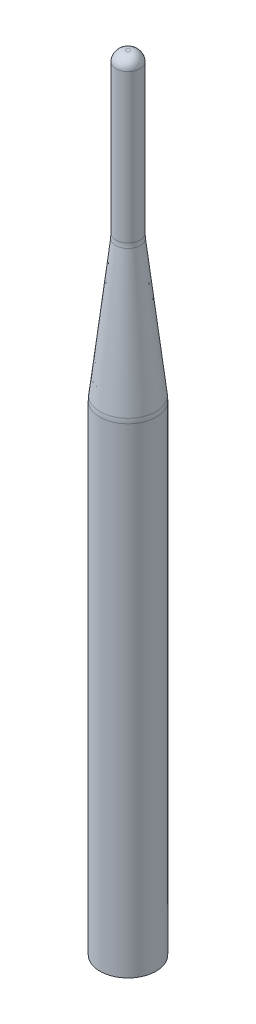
ISO-10303-21;
HEADER;
FILE_DESCRIPTION(('STEP AP214'),'2;1');
FILE_NAME('part.step','',(''),(''),'','','');
FILE_SCHEMA(('AUTOMOTIVE_DESIGN { 1 0 10303 214 1 1 1 1 }'));
ENDSEC;
DATA;
#1=APPLICATION_CONTEXT('core data for automotive mechanical design processes');
#2=APPLICATION_PROTOCOL_DEFINITION('international standard','automotive_design',2000,#1);
#3=PRODUCT_CONTEXT('',#1,'mechanical');
#4=PRODUCT('Part','Part','',(#3));
#5=PRODUCT_RELATED_PRODUCT_CATEGORY('part','',(#4));
#6=PRODUCT_DEFINITION_FORMATION('','',#4);
#7=PRODUCT_DEFINITION_CONTEXT('part definition',#1,'design');
#8=PRODUCT_DEFINITION('design','',#6,#7);
#9=PRODUCT_DEFINITION_SHAPE('','',#8);
#10=(LENGTH_UNIT() NAMED_UNIT(*) SI_UNIT(.MILLI.,.METRE.));
#11=(NAMED_UNIT(*) PLANE_ANGLE_UNIT() SI_UNIT($,.RADIAN.));
#12=(NAMED_UNIT(*) SI_UNIT($,.STERADIAN.) SOLID_ANGLE_UNIT());
#13=UNCERTAINTY_MEASURE_WITH_UNIT(LENGTH_MEASURE(1.E-05),#10,'distance_accuracy_value','');
#14=(GEOMETRIC_REPRESENTATION_CONTEXT(3) GLOBAL_UNCERTAINTY_ASSIGNED_CONTEXT((#13)) GLOBAL_UNIT_ASSIGNED_CONTEXT((#10,
#11,#12)) REPRESENTATION_CONTEXT('',''));
#15=CARTESIAN_POINT('',(0.,0.,0.));
#16=DIRECTION('',(0.,0.,1.));
#17=DIRECTION('',(1.,0.,0.));
#18=AXIS2_PLACEMENT_3D('',#15,#16,#17);
#19=CARTESIAN_POINT('',(0.,0.,0.));
#20=DIRECTION('',(0.,-1.,0.));
#21=DIRECTION('',(0.,0.,-1.));
#22=AXIS2_PLACEMENT_3D('',#19,#20,#21);
#23=PLANE('',#22);
#24=CARTESIAN_POINT('',(0.,0.,0.));
#25=DIRECTION('',(0.,-1.,0.));
#26=DIRECTION('',(0.,0.,-1.));
#27=AXIS2_PLACEMENT_3D('',#24,#25,#26);
#28=CIRCLE('',#27,7.);
#29=CARTESIAN_POINT('',(0.,0.,-7.));
#30=VERTEX_POINT('',#29);
#31=EDGE_CURVE('E10',#30,#30,#28,.T.);
#32=ORIENTED_EDGE('',*,*,#31,.T.);
#33=EDGE_LOOP('',(#32));
#34=FACE_BOUND('',#33,.T.);
#35=ADVANCED_FACE('F31',(#34),#23,.T.);
#36=CARTESIAN_POINT('',(0.,0.,0.));
#37=DIRECTION('',(0.,-1.,0.));
#38=DIRECTION('',(0.,0.,-1.));
#39=AXIS2_PLACEMENT_3D('',#36,#37,#38);
#40=CYLINDRICAL_SURFACE('',#39,7.);
#41=CARTESIAN_POINT('',(0.,119.430425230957,0.));
#42=DIRECTION('',(0.,-1.,0.));
#43=DIRECTION('',(0.,0.,-1.));
#44=AXIS2_PLACEMENT_3D('',#41,#42,#43);
#45=CIRCLE('',#44,7.);
#46=CARTESIAN_POINT('',(0.,119.430425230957,-7.));
#47=VERTEX_POINT('',#46);
#48=EDGE_CURVE('E37',#47,#47,#45,.T.);
#49=ORIENTED_EDGE('',*,*,#48,.T.);
#50=EDGE_LOOP('',(#49));
#51=FACE_BOUND('',#50,.T.);
#52=ORIENTED_EDGE('',*,*,#31,.F.);
#53=EDGE_LOOP('',(#52));
#54=FACE_BOUND('',#53,.T.);
#55=ADVANCED_FACE('F72',(#51,#54),#40,.T.);
#56=CARTESIAN_POINT('',(0.,119.430425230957,0.));
#57=DIRECTION('',(0.,-1.,0.));
#58=DIRECTION('',(0.,0.,-1.));
#59=AXIS2_PLACEMENT_3D('',#56,#57,#58);
#60=DEGENERATE_TOROIDAL_SURFACE('',#59,3.,10.,.F.);
#61=CARTESIAN_POINT('',(0.,120.565891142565,0.));
#62=DIRECTION('',(0.,-1.,0.));
#63=DIRECTION('',(0.,0.,-1.));
#64=AXIS2_PLACEMENT_3D('',#61,#62,#63);
#65=CIRCLE('',#64,6.93532672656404);
#66=CARTESIAN_POINT('',(0.,120.565891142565,-6.93532672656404));
#67=VERTEX_POINT('',#66);
#68=EDGE_CURVE('E41',#67,#67,#65,.T.);
#69=ORIENTED_EDGE('',*,*,#68,.T.);
#70=EDGE_LOOP('',(#69));
#71=FACE_BOUND('',#70,.T.);
#72=ORIENTED_EDGE('',*,*,#48,.F.);
#73=EDGE_LOOP('',(#72));
#74=FACE_BOUND('',#73,.T.);
#75=ADVANCED_FACE('F76',(#71,#74),#60,.F.);
#76=CARTESIAN_POINT('',(0.,120.565891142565,0.));
#77=DIRECTION('',(0.,-1.,0.));
#78=DIRECTION('',(0.,0.,-1.));
#79=AXIS2_PLACEMENT_3D('',#76,#77,#78);
#80=CONICAL_SURFACE('',#79,6.93532672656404,0.113792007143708);
#81=CARTESIAN_POINT('',(0.,154.434108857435,0.));
#82=DIRECTION('',(0.,-1.,0.));
#83=DIRECTION('',(0.,0.,-1.));
#84=AXIS2_PLACEMENT_3D('',#81,#82,#83);
#85=CIRCLE('',#84,3.06467327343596);
#86=CARTESIAN_POINT('',(0.,154.434108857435,-3.06467327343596));
#87=VERTEX_POINT('',#86);
#88=EDGE_CURVE('E45',#87,#87,#85,.T.);
#89=ORIENTED_EDGE('',*,*,#88,.T.);
#90=EDGE_LOOP('',(#89));
#91=FACE_BOUND('',#90,.T.);
#92=ORIENTED_EDGE('',*,*,#68,.F.);
#93=EDGE_LOOP('',(#92));
#94=FACE_BOUND('',#93,.T.);
#95=ADVANCED_FACE('F80',(#91,#94),#80,.T.);
#96=CARTESIAN_POINT('',(0.,155.569574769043,0.));
#97=DIRECTION('',(0.,-1.,0.));
#98=DIRECTION('',(0.,0.,-1.));
#99=AXIS2_PLACEMENT_3D('',#96,#97,#98);
#100=TOROIDAL_SURFACE('',#99,13.,10.);
#101=CARTESIAN_POINT('',(0.,155.569574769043,0.));
#102=DIRECTION('',(0.,-1.,0.));
#103=DIRECTION('',(0.,0.,-1.));
#104=AXIS2_PLACEMENT_3D('',#101,#102,#103);
#105=CIRCLE('',#104,3.00000000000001);
#106=CARTESIAN_POINT('',(0.,155.569574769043,-3.00000000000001));
#107=VERTEX_POINT('',#106);
#108=EDGE_CURVE('E50',#107,#107,#105,.T.);
#109=ORIENTED_EDGE('',*,*,#108,.T.);
#110=EDGE_LOOP('',(#109));
#111=FACE_BOUND('',#110,.T.);
#112=ORIENTED_EDGE('',*,*,#88,.F.);
#113=EDGE_LOOP('',(#112));
#114=FACE_BOUND('',#113,.T.);
#115=ADVANCED_FACE('F87',(#111,#114),#100,.F.);
#116=CARTESIAN_POINT('',(0.,0.,0.));
#117=DIRECTION('',(0.,-1.,0.));
#118=DIRECTION('',(0.,0.,-1.));
#119=AXIS2_PLACEMENT_3D('',#116,#117,#118);
#120=CYLINDRICAL_SURFACE('',#119,3.);
#121=CARTESIAN_POINT('',(0.,192.5,0.));
#122=DIRECTION('',(0.,-1.,0.));
#123=DIRECTION('',(0.,0.,-1.));
#124=AXIS2_PLACEMENT_3D('',#121,#122,#123);
#125=CIRCLE('',#124,3.);
#126=CARTESIAN_POINT('',(0.,192.5,-3.));
#127=VERTEX_POINT('',#126);
#128=EDGE_CURVE('E53',#127,#127,#125,.T.);
#129=ORIENTED_EDGE('',*,*,#128,.T.);
#130=EDGE_LOOP('',(#129));
#131=FACE_BOUND('',#130,.T.);
#132=ORIENTED_EDGE('',*,*,#108,.F.);
#133=EDGE_LOOP('',(#132));
#134=FACE_BOUND('',#133,.T.);
#135=ADVANCED_FACE('F69',(#131,#134),#120,.T.);
#136=CARTESIAN_POINT('',(0.,192.5,0.));
#137=DIRECTION('',(0.,-1.,0.));
#138=DIRECTION('',(0.,0.,-1.));
#139=AXIS2_PLACEMENT_3D('',#136,#137,#138);
#140=DEGENERATE_TOROIDAL_SURFACE('',#139,0.5,2.5,.T.);
#141=CARTESIAN_POINT('',(0.,195.,0.));
#142=DIRECTION('',(0.,-1.,0.));
#143=DIRECTION('',(0.,0.,-1.));
#144=AXIS2_PLACEMENT_3D('',#141,#142,#143);
#145=CIRCLE('',#144,0.499999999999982);
#146=CARTESIAN_POINT('',(0.,195.,-0.499999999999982));
#147=VERTEX_POINT('',#146);
#148=EDGE_CURVE('E56',#147,#147,#145,.T.);
#149=ORIENTED_EDGE('',*,*,#148,.T.);
#150=EDGE_LOOP('',(#149));
#151=FACE_BOUND('',#150,.T.);
#152=ORIENTED_EDGE('',*,*,#128,.F.);
#153=EDGE_LOOP('',(#152));
#154=FACE_BOUND('',#153,.T.);
#155=ADVANCED_FACE('F60',(#151,#154),#140,.T.);
#156=CARTESIAN_POINT('',(0.,195.,0.));
#157=DIRECTION('',(0.,1.,0.));
#158=DIRECTION('',(0.,0.,1.));
#159=AXIS2_PLACEMENT_3D('',#156,#157,#158);
#160=PLANE('',#159);
#161=ORIENTED_EDGE('',*,*,#148,.F.);
#162=EDGE_LOOP('',(#161));
#163=FACE_BOUND('',#162,.T.);
#164=ADVANCED_FACE('F63',(#163),#160,.T.);
#165=CLOSED_SHELL('',(#35,#55,#75,#95,#115,#135,#155,#164));
#166=MANIFOLD_SOLID_BREP('B2',#165);
#167=ADVANCED_BREP_SHAPE_REPRESENTATION('',(#18,#166),#14);
#168=SHAPE_DEFINITION_REPRESENTATION(#9,#167);
ENDSEC;
END-ISO-10303-21;
